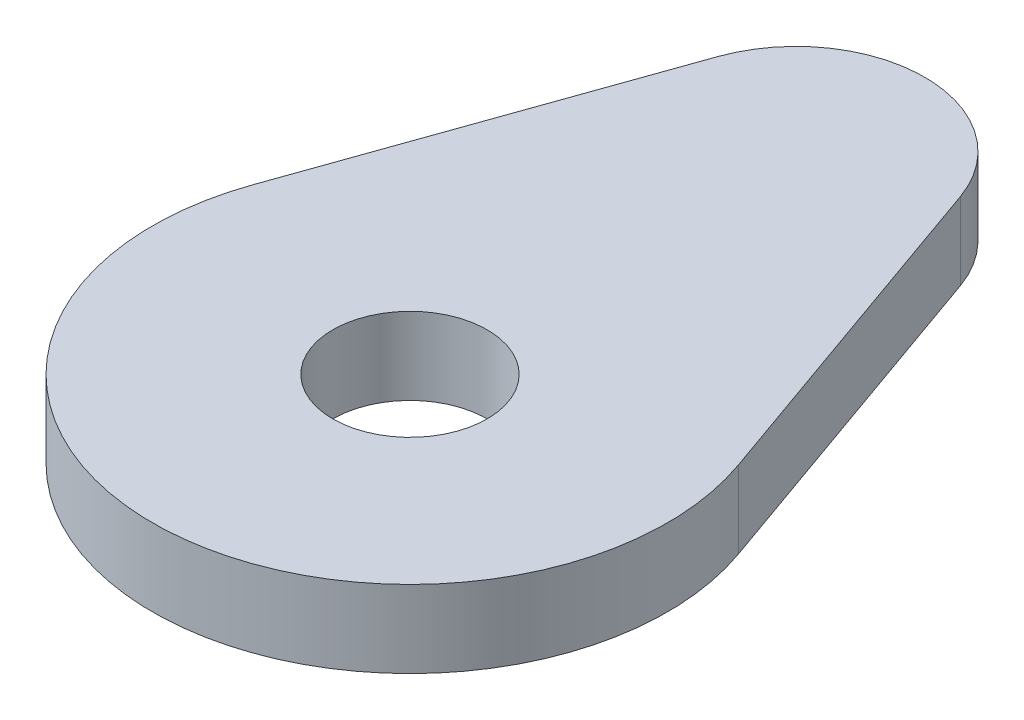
from build123d import *

# Parameters (mm, degrees)
SKETCH1_R      = 3
EXTRUDE2_DEPTH = 3


with BuildPart() as part:
    # Sketch1 → Extrude2 (new body)
    with BuildSketch(Plane(origin=(0, 0, 0), x_dir=(1, 0, 0), z_dir=(0, 1, 0))):
        with BuildLine():
            Line((4.714045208, 16.666666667), (9.428090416, 3.333333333))
            ThreePointArc((9.428090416, 3.333333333), (0, -10), (-9.428090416, 3.333333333))
            Line((-9.428090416, 3.333333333), (-4.714045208, 16.666666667))
            ThreePointArc((-4.714045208, 16.666666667), (0, 20), (4.714045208, 16.666666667))
        make_face()
        with Locations(Location((0, 0, 0), (0, 0, 270))):
            Circle(SKETCH1_R, mode=Mode.SUBTRACT)
    extrude(amount=EXTRUDE2_DEPTH)


solid = part.part
